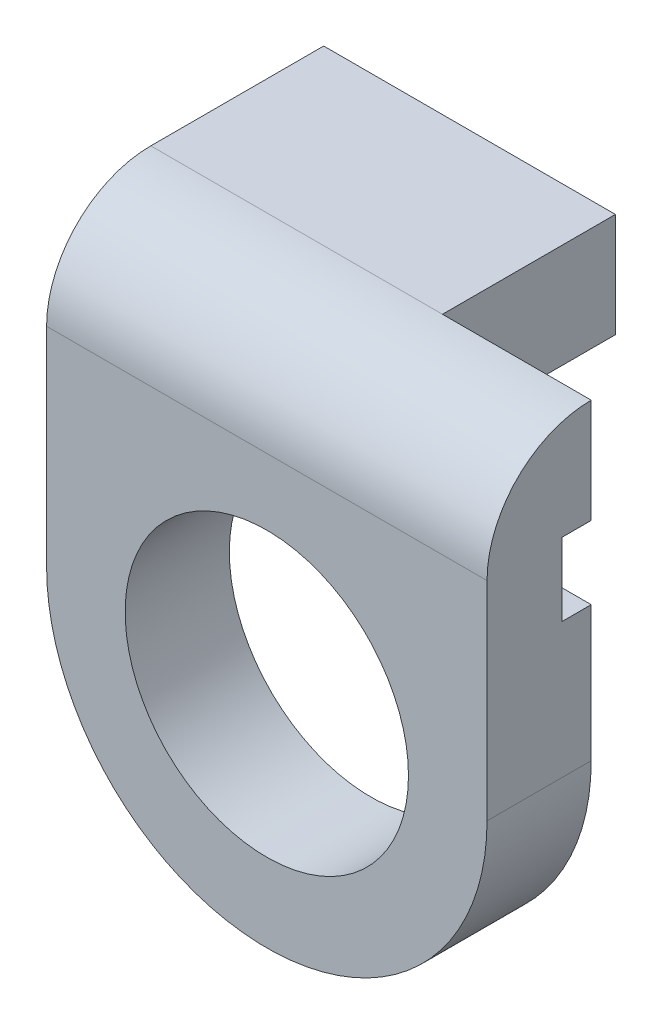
from build123d import *

# Parameters (mm, degrees)
ESQUISSE1_R             = 6.798728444
BASE_EXTRUSION_DEPTH    = 5
ESQUISSE4_W             = 14
ESQUISSE4_H             = 5
BOSS_EXTRU_1_DEPTH      = 8.3
ESQUISSE5_W             = 1.4
ESQUISSE5_H             = 3.5
ENL_V_MAT_EXTRU_1_DEPTH = 227.59524402
CONG_1_R                = 5


with BuildPart() as part:
    # Esquisse1 → Base-Extrusion (new body)
    with BuildSketch(Plane.XY):
        with BuildLine():
            Line((-37.688093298, 225.214717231), (-37.688093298, 210.228483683))
            ThreePointArc((-37.688093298, 210.228483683), (-48.257456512, 199.659120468), (-58.826819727, 210.228483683))
            Line((-58.826819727, 210.228483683), (-58.826819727, 225.214717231))
            Line((-58.826819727, 225.214717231), (-37.688093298, 225.214717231))
        make_face()
        with Locations((-48.257456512, 210.228483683)):
            Circle(ESQUISSE1_R, mode=Mode.SUBTRACT)
    extrude(amount=-BASE_EXTRUSION_DEPTH)

    # Esquisse4 → Boss.-Extru.1 (add)
    with BuildSketch(Plane(origin=(0, 0, -5), x_dir=(-1, 0, 0), z_dir=(0, 0, -1))):
        with Locations((51.826819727, 222.714717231)):
            Rectangle(ESQUISSE4_W, ESQUISSE4_H)
    extrude(amount=BOSS_EXTRU_1_DEPTH)

    # Esquisse5 → Enl_v. mat.-Extru.1 (cut, through all)
    with BuildSketch(Plane.ZY.offset(58.826819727)):
        with Locations((-4.3, 218.464717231)):
            Rectangle(ESQUISSE5_W, ESQUISSE5_H)
    extrude(amount=-ENL_V_MAT_EXTRU_1_DEPTH, mode=Mode.SUBTRACT)

    # Cong_1
    cong_1_edges = [part.edges().sort_by_distance(p)[0] for p in [
        (-48.257456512, 225.214717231, 0),
    ]]
    fillet(cong_1_edges, radius=CONG_1_R)


solid = part.part
